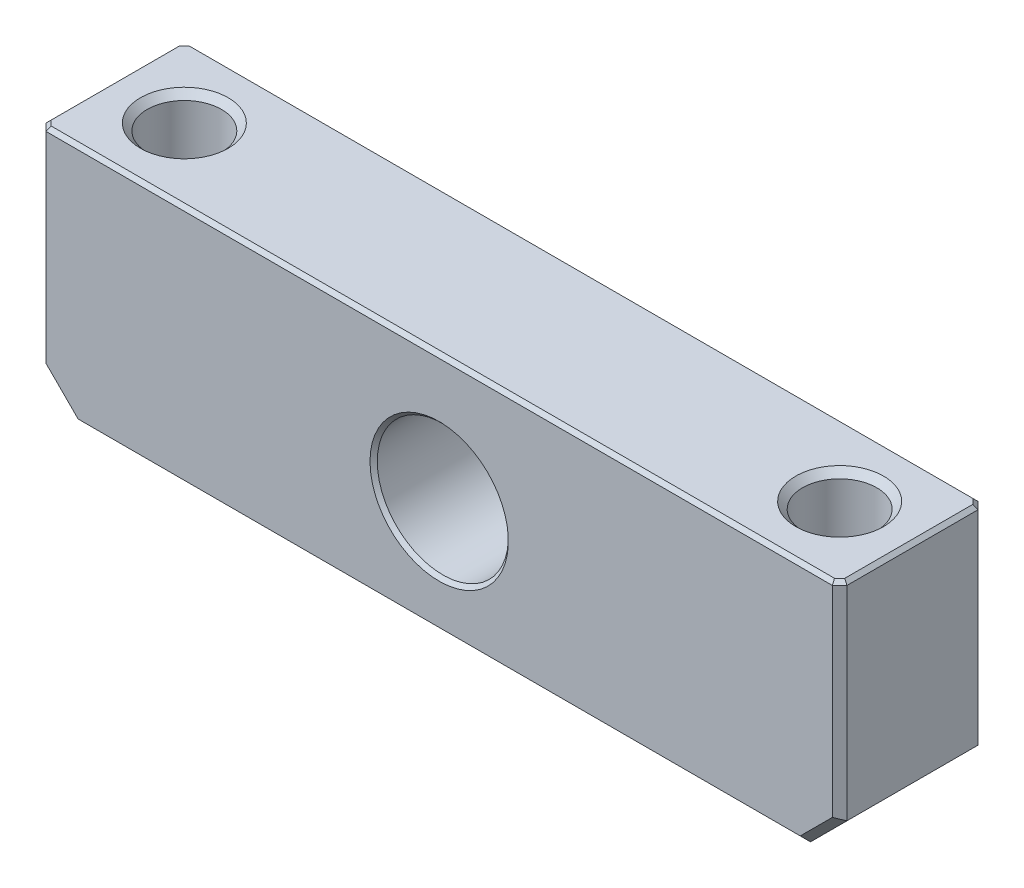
from build123d import *

# Parameters (mm, degrees)
VOLUME_DEPTH                   = 10
VOLUME_DEPTH_BACK              = 10
ESQUISSE1_W                    = 110
ESQUISSE1_H                    = 33.5
ESQUISSE1_R                    = 9
TROUS_TARAUD_S_M12_D           = 10.2
TROUS_TARAUD_S_M12_DEPTH       = 27
TROUS_TARAUD_S_M12_CSINK_D     = 12.05
TROUS_TARAUD_S_M12_CSINK_ANGLE = 90
TROUS_TARAUD_S_M12_TIP         = 3.064389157
CHANFREINS_5MM_SIZE            = 5
CHANFREINS_1MM_SIZE            = 1
CHANFREINS_0_5MM_SIZE          = 0.5


with BuildPart() as part:
    # Esquisse1 → Volume (new, two sides: drawn at the far end of the back side and taken through both)
    with BuildSketch(Plane.XY.offset(-VOLUME_DEPTH_BACK)):
        with Locations((0, 0.75)):
            Rectangle(ESQUISSE1_W, ESQUISSE1_H)
        Circle(ESQUISSE1_R, mode=Mode.SUBTRACT)
    extrude(amount=VOLUME_DEPTH + VOLUME_DEPTH_BACK)

    # Trous taraud_s M12
    with Locations(Plane(origin=(-45, 17.5, 0), x_dir=(0, 0, 1), z_dir=(0, 1, 0))):
        with Locations((0, 0), (0, 90)):
            CounterSinkHole(TROUS_TARAUD_S_M12_D / 2, TROUS_TARAUD_S_M12_CSINK_D / 2, depth=TROUS_TARAUD_S_M12_DEPTH, counter_sink_angle=TROUS_TARAUD_S_M12_CSINK_ANGLE)
            with Locations((0, 0, -(TROUS_TARAUD_S_M12_DEPTH + TROUS_TARAUD_S_M12_TIP / 2))):  # 118° drill point
                Cone(0, TROUS_TARAUD_S_M12_D / 2, TROUS_TARAUD_S_M12_TIP, mode=Mode.SUBTRACT)

    # Chanfreins 5mm
    chanfreins_5mm_edges = [part.edges().sort_by_distance(p)[0] for p in [
        (55, -16, 0),
        (-55, -16, 0),
    ]]
    chamfer(chanfreins_5mm_edges, length=CHANFREINS_5MM_SIZE)

    # Chanfreins 1mm
    chanfreins_1mm_edges = [part.edges().sort_by_distance(p)[0] for p in [
        (-55, 3.25, 10),
        (0, -16, 10),
        (55, 3.25, 10),
        (52.5, -13.5, 10),
        (-52.5, -13.5, 10),
        (0, -16, -10),
        (55, 3.25, -10),
        (52.5, -13.5, -10),
        (-52.5, -13.5, -10),
        (-55, 3.25, -10),
    ]]
    chamfer(chanfreins_1mm_edges, length=CHANFREINS_1MM_SIZE)

    # Chanfreins 0.5mm
    chanfreins_0_5mm_edges = [part.edges().sort_by_distance(p)[0] for p in [
        (-9, 0, -10),
        (-9, 0, 10),
        (0, 17.5, 10),
        (-55, 17.5, 0),
        (55, 17.5, 0),
        (0, 17.5, -10),
        (-54.5, 17.5, -9.5),
        (54.5, 17.5, -9.5),
        (-54.5, 17.5, 9.5),
        (54.5, 17.5, 9.5),
    ]]
    chamfer(chanfreins_0_5mm_edges, length=CHANFREINS_0_5MM_SIZE)


solid = part.part
